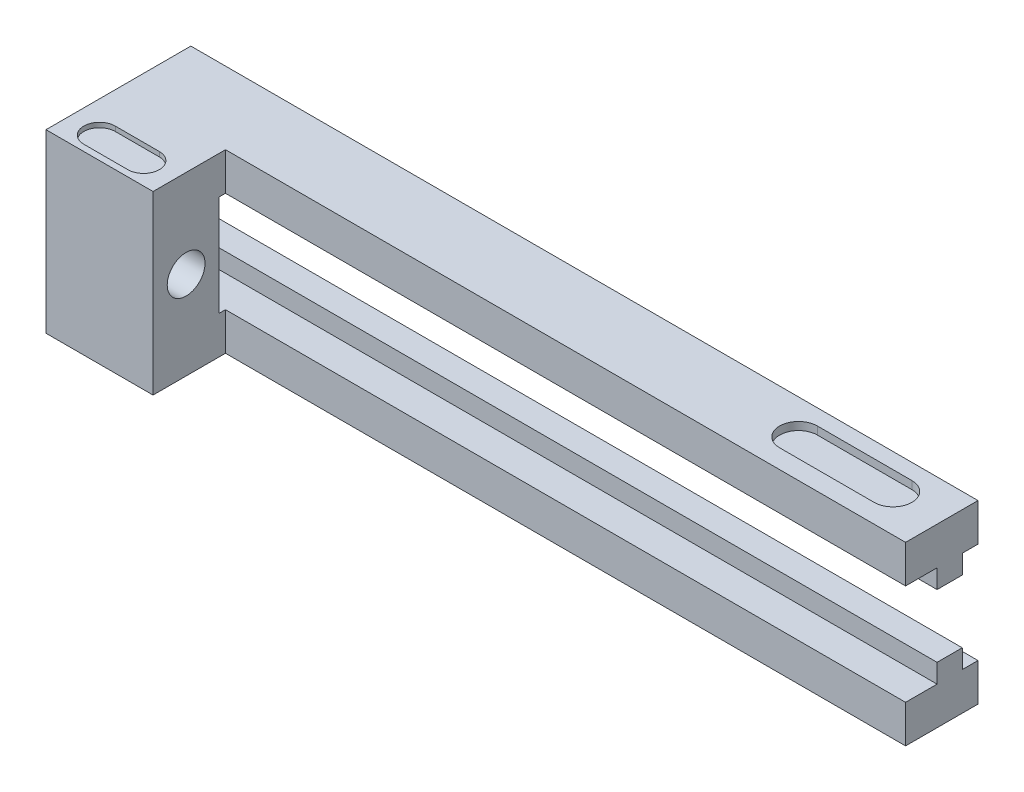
ISO-10303-21;
HEADER;
FILE_DESCRIPTION(('STEP AP214'),'2;1');
FILE_NAME('part.step','',(''),(''),'','','');
FILE_SCHEMA(('AUTOMOTIVE_DESIGN { 1 0 10303 214 1 1 1 1 }'));
ENDSEC;
DATA;
#1=APPLICATION_CONTEXT('core data for automotive mechanical design processes');
#2=APPLICATION_PROTOCOL_DEFINITION('international standard','automotive_design',2000,#1);
#3=PRODUCT_CONTEXT('',#1,'mechanical');
#4=PRODUCT('Part','Part','',(#3));
#5=PRODUCT_RELATED_PRODUCT_CATEGORY('part','',(#4));
#6=PRODUCT_DEFINITION_FORMATION('','',#4);
#7=PRODUCT_DEFINITION_CONTEXT('part definition',#1,'design');
#8=PRODUCT_DEFINITION('design','',#6,#7);
#9=PRODUCT_DEFINITION_SHAPE('','',#8);
#10=(LENGTH_UNIT() NAMED_UNIT(*) SI_UNIT(.MILLI.,.METRE.));
#11=(NAMED_UNIT(*) PLANE_ANGLE_UNIT() SI_UNIT($,.RADIAN.));
#12=(NAMED_UNIT(*) SI_UNIT($,.STERADIAN.) SOLID_ANGLE_UNIT());
#13=UNCERTAINTY_MEASURE_WITH_UNIT(LENGTH_MEASURE(1.E-05),#10,'distance_accuracy_value','');
#14=(GEOMETRIC_REPRESENTATION_CONTEXT(3) GLOBAL_UNCERTAINTY_ASSIGNED_CONTEXT((#13)) GLOBAL_UNIT_ASSIGNED_CONTEXT((#10,
#11,#12)) REPRESENTATION_CONTEXT('',''));
#15=CARTESIAN_POINT('',(0.,0.,0.));
#16=DIRECTION('',(0.,0.,1.));
#17=DIRECTION('',(1.,0.,0.));
#18=AXIS2_PLACEMENT_3D('',#15,#16,#17);
#19=CARTESIAN_POINT('',(17.,-26.5,34.));
#20=DIRECTION('',(0.,1.,0.));
#21=DIRECTION('',(0.,0.,-1.));
#22=AXIS2_PLACEMENT_3D('',#19,#20,#21);
#23=PLANE('',#22);
#24=DIRECTION('',(-1.,0.,0.));
#25=VECTOR('',#24,1.);
#26=CARTESIAN_POINT('',(24.,-26.5,39.));
#27=LINE('',#26,#25);
#28=CARTESIAN_POINT('',(10.,-26.5,39.));
#29=VERTEX_POINT('',#28);
#30=CARTESIAN_POINT('',(24.,-26.5,39.));
#31=VERTEX_POINT('',#30);
#32=EDGE_CURVE('E689',#29,#31,#27,.F.);
#33=ORIENTED_EDGE('',*,*,#32,.F.);
#34=CARTESIAN_POINT('',(10.,-26.5,34.));
#35=DIRECTION('',(0.,-1.,0.));
#36=DIRECTION('',(0.,0.,1.));
#37=AXIS2_PLACEMENT_3D('',#34,#35,#36);
#38=CIRCLE('',#37,5.);
#39=CARTESIAN_POINT('',(10.,-26.5,29.));
#40=VERTEX_POINT('',#39);
#41=EDGE_CURVE('E201',#29,#40,#38,.T.);
#42=ORIENTED_EDGE('',*,*,#41,.T.);
#43=DIRECTION('',(1.,0.,0.));
#44=VECTOR('',#43,1.);
#45=CARTESIAN_POINT('',(10.,-26.5,29.));
#46=LINE('',#45,#44);
#47=CARTESIAN_POINT('',(24.,-26.5,29.));
#48=VERTEX_POINT('',#47);
#49=EDGE_CURVE('E204',#48,#40,#46,.F.);
#50=ORIENTED_EDGE('',*,*,#49,.F.);
#51=CARTESIAN_POINT('',(24.,-26.5,34.));
#52=DIRECTION('',(0.,-1.,0.));
#53=DIRECTION('',(0.,0.,1.));
#54=AXIS2_PLACEMENT_3D('',#51,#52,#53);
#55=CIRCLE('',#54,5.);
#56=EDGE_CURVE('E197',#48,#31,#55,.T.);
#57=ORIENTED_EDGE('',*,*,#56,.T.);
#58=EDGE_LOOP('',(#33,#42,#50,#57));
#59=FACE_BOUND('',#58,.T.);
#60=ADVANCED_FACE('F14',(#59),#23,.F.);
#61=CARTESIAN_POINT('',(219.,-25.5,6.));
#62=DIRECTION('',(0.,-1.,0.));
#63=DIRECTION('',(1.,0.,0.));
#64=AXIS2_PLACEMENT_3D('',#61,#62,#63);
#65=PLANE('',#64);
#66=CARTESIAN_POINT('',(204.,-25.5,6.));
#67=DIRECTION('',(0.,1.,0.));
#68=DIRECTION('',(0.,0.,-1.));
#69=AXIS2_PLACEMENT_3D('',#66,#67,#68);
#70=CIRCLE('',#69,6.);
#71=CARTESIAN_POINT('',(204.,-25.5,12.));
#72=VERTEX_POINT('',#71);
#73=CARTESIAN_POINT('',(204.,-25.5,0.));
#74=VERTEX_POINT('',#73);
#75=EDGE_CURVE('E190',#72,#74,#70,.F.);
#76=ORIENTED_EDGE('',*,*,#75,.T.);
#77=DIRECTION('',(-1.,0.,0.));
#78=VECTOR('',#77,1.);
#79=CARTESIAN_POINT('',(234.,-25.5,0.));
#80=LINE('',#79,#78);
#81=CARTESIAN_POINT('',(234.,-25.5,0.));
#82=VERTEX_POINT('',#81);
#83=EDGE_CURVE('E685',#74,#82,#80,.F.);
#84=ORIENTED_EDGE('',*,*,#83,.T.);
#85=CARTESIAN_POINT('',(234.,-25.5,6.));
#86=DIRECTION('',(0.,1.,0.));
#87=DIRECTION('',(0.,0.,-1.));
#88=AXIS2_PLACEMENT_3D('',#85,#86,#87);
#89=CIRCLE('',#88,6.);
#90=CARTESIAN_POINT('',(234.,-25.5,12.));
#91=VERTEX_POINT('',#90);
#92=EDGE_CURVE('E193',#82,#91,#89,.F.);
#93=ORIENTED_EDGE('',*,*,#92,.T.);
#94=DIRECTION('',(1.,0.,0.));
#95=VECTOR('',#94,1.);
#96=CARTESIAN_POINT('',(204.,-25.5,12.));
#97=LINE('',#96,#95);
#98=EDGE_CURVE('E196',#91,#72,#97,.F.);
#99=ORIENTED_EDGE('',*,*,#98,.T.);
#100=EDGE_LOOP('',(#76,#84,#93,#99));
#101=FACE_BOUND('',#100,.T.);
#102=ADVANCED_FACE('F335',(#101),#65,.T.);
#103=CARTESIAN_POINT('',(17.,26.5,34.));
#104=DIRECTION('',(0.,1.,0.));
#105=DIRECTION('',(-1.,0.,0.));
#106=AXIS2_PLACEMENT_3D('',#103,#104,#105);
#107=PLANE('',#106);
#108=CARTESIAN_POINT('',(10.,26.5,34.));
#109=DIRECTION('',(0.,-1.,0.));
#110=DIRECTION('',(0.,0.,1.));
#111=AXIS2_PLACEMENT_3D('',#108,#109,#110);
#112=CIRCLE('',#111,5.);
#113=CARTESIAN_POINT('',(10.,26.5,29.));
#114=VERTEX_POINT('',#113);
#115=CARTESIAN_POINT('',(10.,26.5,39.));
#116=VERTEX_POINT('',#115);
#117=EDGE_CURVE('E18',#114,#116,#112,.F.);
#118=ORIENTED_EDGE('',*,*,#117,.T.);
#119=DIRECTION('',(1.,0.,0.));
#120=VECTOR('',#119,1.);
#121=CARTESIAN_POINT('',(24.,26.5,39.));
#122=LINE('',#121,#120);
#123=CARTESIAN_POINT('',(24.,26.5,39.));
#124=VERTEX_POINT('',#123);
#125=EDGE_CURVE('E167',#116,#124,#122,.T.);
#126=ORIENTED_EDGE('',*,*,#125,.T.);
#127=CARTESIAN_POINT('',(24.,26.5,34.));
#128=DIRECTION('',(0.,-1.,0.));
#129=DIRECTION('',(0.,0.,1.));
#130=AXIS2_PLACEMENT_3D('',#127,#128,#129);
#131=CIRCLE('',#130,5.);
#132=CARTESIAN_POINT('',(24.,26.5,29.));
#133=VERTEX_POINT('',#132);
#134=EDGE_CURVE('E138',#124,#133,#131,.F.);
#135=ORIENTED_EDGE('',*,*,#134,.T.);
#136=DIRECTION('',(-1.,0.,0.));
#137=VECTOR('',#136,1.);
#138=CARTESIAN_POINT('',(10.,26.5,29.));
#139=LINE('',#138,#137);
#140=EDGE_CURVE('E134',#133,#114,#139,.T.);
#141=ORIENTED_EDGE('',*,*,#140,.T.);
#142=EDGE_LOOP('',(#118,#126,#135,#141));
#143=FACE_BOUND('',#142,.T.);
#144=ADVANCED_FACE('F16',(#143),#107,.T.);
#145=CARTESIAN_POINT('',(219.,25.5,6.));
#146=DIRECTION('',(0.,-1.,0.));
#147=DIRECTION('',(1.,0.,0.));
#148=AXIS2_PLACEMENT_3D('',#145,#146,#147);
#149=PLANE('',#148);
#150=DIRECTION('',(1.,0.,0.));
#151=VECTOR('',#150,1.);
#152=CARTESIAN_POINT('',(234.,25.5,0.));
#153=LINE('',#152,#151);
#154=CARTESIAN_POINT('',(204.,25.5,0.));
#155=VERTEX_POINT('',#154);
#156=CARTESIAN_POINT('',(234.,25.5,0.));
#157=VERTEX_POINT('',#156);
#158=EDGE_CURVE('E159',#155,#157,#153,.T.);
#159=ORIENTED_EDGE('',*,*,#158,.F.);
#160=CARTESIAN_POINT('',(204.,25.5,6.));
#161=DIRECTION('',(0.,1.,0.));
#162=DIRECTION('',(0.,0.,-1.));
#163=AXIS2_PLACEMENT_3D('',#160,#161,#162);
#164=CIRCLE('',#163,6.);
#165=CARTESIAN_POINT('',(204.,25.5,12.));
#166=VERTEX_POINT('',#165);
#167=EDGE_CURVE('E217',#155,#166,#164,.T.);
#168=ORIENTED_EDGE('',*,*,#167,.T.);
#169=DIRECTION('',(-1.,0.,0.));
#170=VECTOR('',#169,1.);
#171=CARTESIAN_POINT('',(204.,25.5,12.));
#172=LINE('',#171,#170);
#173=CARTESIAN_POINT('',(234.,25.5,12.));
#174=VERTEX_POINT('',#173);
#175=EDGE_CURVE('E169',#174,#166,#172,.T.);
#176=ORIENTED_EDGE('',*,*,#175,.F.);
#177=CARTESIAN_POINT('',(234.,25.5,6.));
#178=DIRECTION('',(0.,1.,0.));
#179=DIRECTION('',(0.,0.,-1.));
#180=AXIS2_PLACEMENT_3D('',#177,#178,#179);
#181=CIRCLE('',#180,6.);
#182=EDGE_CURVE('E157',#174,#157,#181,.T.);
#183=ORIENTED_EDGE('',*,*,#182,.T.);
#184=EDGE_LOOP('',(#159,#168,#176,#183));
#185=FACE_BOUND('',#184,.T.);
#186=ADVANCED_FACE('F322',(#185),#149,.F.);
#187=CARTESIAN_POINT('',(0.,-16.,0.));
#188=DIRECTION('',(0.,0.,-1.));
#189=DIRECTION('',(0.,-1.,0.));
#190=AXIS2_PLACEMENT_3D('',#187,#188,#189);
#191=PLANE('',#190);
#192=DIRECTION('',(0.,1.,0.));
#193=VECTOR('',#192,1.);
#194=CARTESIAN_POINT('',(250.,-20.0975609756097,0.));
#195=LINE('',#194,#193);
#196=CARTESIAN_POINT('',(250.,-16.,0.));
#197=VERTEX_POINT('',#196);
#198=CARTESIAN_POINT('',(250.,-10.,0.));
#199=VERTEX_POINT('',#198);
#200=EDGE_CURVE('E744',#197,#199,#195,.T.);
#201=ORIENTED_EDGE('',*,*,#200,.F.);
#202=DIRECTION('',(-1.,0.,0.));
#203=VECTOR('',#202,1.);
#204=CARTESIAN_POINT('',(0.,-16.,0.));
#205=LINE('',#204,#203);
#206=CARTESIAN_POINT('',(0.,-16.,0.));
#207=VERTEX_POINT('',#206);
#208=EDGE_CURVE('E267',#197,#207,#205,.T.);
#209=ORIENTED_EDGE('',*,*,#208,.T.);
#210=DIRECTION('',(0.,1.,0.));
#211=VECTOR('',#210,1.);
#212=CARTESIAN_POINT('',(0.,20.0975609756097,0.));
#213=LINE('',#212,#211);
#214=CARTESIAN_POINT('',(0.,-10.,0.));
#215=VERTEX_POINT('',#214);
#216=EDGE_CURVE('E641',#207,#215,#213,.T.);
#217=ORIENTED_EDGE('',*,*,#216,.T.);
#218=DIRECTION('',(-1.,0.,0.));
#219=VECTOR('',#218,1.);
#220=CARTESIAN_POINT('',(0.,-10.,0.));
#221=LINE('',#220,#219);
#222=EDGE_CURVE('E264',#199,#215,#221,.T.);
#223=ORIENTED_EDGE('',*,*,#222,.F.);
#224=EDGE_LOOP('',(#201,#209,#217,#223));
#225=FACE_BOUND('',#224,.T.);
#226=ADVANCED_FACE('F378',(#225),#191,.T.);
#227=CARTESIAN_POINT('',(0.,10.,0.));
#228=DIRECTION('',(0.,1.,0.));
#229=DIRECTION('',(0.,0.,-1.));
#230=AXIS2_PLACEMENT_3D('',#227,#228,#229);
#231=PLANE('',#230);
#232=DIRECTION('',(-1.,0.,0.));
#233=VECTOR('',#232,1.);
#234=CARTESIAN_POINT('',(0.,10.,0.));
#235=LINE('',#234,#233);
#236=CARTESIAN_POINT('',(0.,10.,0.));
#237=VERTEX_POINT('',#236);
#238=CARTESIAN_POINT('',(250.,10.,0.));
#239=VERTEX_POINT('',#238);
#240=EDGE_CURVE('E285',#237,#239,#235,.F.);
#241=ORIENTED_EDGE('',*,*,#240,.T.);
#242=DIRECTION('',(0.,0.,-1.));
#243=VECTOR('',#242,1.);
#244=CARTESIAN_POINT('',(250.,10.,0.));
#245=LINE('',#244,#243);
#246=CARTESIAN_POINT('',(250.,10.,8.));
#247=VERTEX_POINT('',#246);
#248=EDGE_CURVE('E288',#247,#239,#245,.T.);
#249=ORIENTED_EDGE('',*,*,#248,.F.);
#250=DIRECTION('',(-1.,0.,0.));
#251=VECTOR('',#250,1.);
#252=CARTESIAN_POINT('',(0.,10.,8.));
#253=LINE('',#252,#251);
#254=CARTESIAN_POINT('',(0.,10.,8.));
#255=VERTEX_POINT('',#254);
#256=EDGE_CURVE('E291',#255,#247,#253,.F.);
#257=ORIENTED_EDGE('',*,*,#256,.F.);
#258=DIRECTION('',(0.,0.,-1.));
#259=VECTOR('',#258,1.);
#260=CARTESIAN_POINT('',(0.,10.,6.1341463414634));
#261=LINE('',#260,#259);
#262=EDGE_CURVE('E663',#255,#237,#261,.T.);
#263=ORIENTED_EDGE('',*,*,#262,.T.);
#264=EDGE_LOOP('',(#241,#249,#257,#263));
#265=FACE_BOUND('',#264,.T.);
#266=ADVANCED_FACE('F381',(#265),#231,.F.);
#267=CARTESIAN_POINT('',(0.,16.,0.));
#268=DIRECTION('',(0.,0.,1.));
#269=DIRECTION('',(0.,1.,0.));
#270=AXIS2_PLACEMENT_3D('',#267,#268,#269);
#271=PLANE('',#270);
#272=DIRECTION('',(-1.,0.,0.));
#273=VECTOR('',#272,1.);
#274=CARTESIAN_POINT('',(0.,16.,0.));
#275=LINE('',#274,#273);
#276=CARTESIAN_POINT('',(0.,16.,0.));
#277=VERTEX_POINT('',#276);
#278=CARTESIAN_POINT('',(250.,16.,0.));
#279=VERTEX_POINT('',#278);
#280=EDGE_CURVE('E279',#277,#279,#275,.F.);
#281=ORIENTED_EDGE('',*,*,#280,.T.);
#282=DIRECTION('',(0.,1.,0.));
#283=VECTOR('',#282,1.);
#284=CARTESIAN_POINT('',(250.,16.,0.));
#285=LINE('',#284,#283);
#286=EDGE_CURVE('E282',#239,#279,#285,.T.);
#287=ORIENTED_EDGE('',*,*,#286,.F.);
#288=ORIENTED_EDGE('',*,*,#240,.F.);
#289=DIRECTION('',(0.,1.,0.));
#290=VECTOR('',#289,1.);
#291=CARTESIAN_POINT('',(0.,20.0975609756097,0.));
#292=LINE('',#291,#290);
#293=EDGE_CURVE('E660',#237,#277,#292,.T.);
#294=ORIENTED_EDGE('',*,*,#293,.T.);
#295=EDGE_LOOP('',(#281,#287,#288,#294));
#296=FACE_BOUND('',#295,.T.);
#297=ADVANCED_FACE('F394',(#296),#271,.F.);
#298=CARTESIAN_POINT('',(0.,16.,-5.));
#299=DIRECTION('',(0.,1.,0.));
#300=DIRECTION('',(0.,0.,-1.));
#301=AXIS2_PLACEMENT_3D('',#298,#299,#300);
#302=PLANE('',#301);
#303=DIRECTION('',(0.,0.,-1.));
#304=VECTOR('',#303,1.);
#305=CARTESIAN_POINT('',(250.,16.,-5.));
#306=LINE('',#305,#304);
#307=CARTESIAN_POINT('',(250.,16.,-5.));
#308=VERTEX_POINT('',#307);
#309=EDGE_CURVE('E276',#279,#308,#306,.T.);
#310=ORIENTED_EDGE('',*,*,#309,.F.);
#311=ORIENTED_EDGE('',*,*,#280,.F.);
#312=DIRECTION('',(0.,0.,-1.));
#313=VECTOR('',#312,1.);
#314=CARTESIAN_POINT('',(0.,16.,6.1341463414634));
#315=LINE('',#314,#313);
#316=CARTESIAN_POINT('',(0.,16.,-5.));
#317=VERTEX_POINT('',#316);
#318=EDGE_CURVE('E657',#277,#317,#315,.T.);
#319=ORIENTED_EDGE('',*,*,#318,.T.);
#320=DIRECTION('',(-1.,0.,0.));
#321=VECTOR('',#320,1.);
#322=CARTESIAN_POINT('',(0.,16.,-5.));
#323=LINE('',#322,#321);
#324=EDGE_CURVE('E273',#317,#308,#323,.F.);
#325=ORIENTED_EDGE('',*,*,#324,.T.);
#326=EDGE_LOOP('',(#310,#311,#319,#325));
#327=FACE_BOUND('',#326,.T.);
#328=ADVANCED_FACE('F385',(#327),#302,.F.);
#329=CARTESIAN_POINT('',(0.,-16.,-5.));
#330=DIRECTION('',(0.,1.,0.));
#331=DIRECTION('',(0.,0.,-1.));
#332=AXIS2_PLACEMENT_3D('',#329,#330,#331);
#333=PLANE('',#332);
#334=DIRECTION('',(0.,0.,1.));
#335=VECTOR('',#334,1.);
#336=CARTESIAN_POINT('',(250.,-16.,6.1341463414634));
#337=LINE('',#336,#335);
#338=CARTESIAN_POINT('',(250.,-16.,-5.));
#339=VERTEX_POINT('',#338);
#340=EDGE_CURVE('E645',#339,#197,#337,.T.);
#341=ORIENTED_EDGE('',*,*,#340,.F.);
#342=DIRECTION('',(-1.,0.,0.));
#343=VECTOR('',#342,1.);
#344=CARTESIAN_POINT('',(0.,-16.,-5.));
#345=LINE('',#344,#343);
#346=CARTESIAN_POINT('',(0.,-16.,-5.));
#347=VERTEX_POINT('',#346);
#348=EDGE_CURVE('E625',#347,#339,#345,.F.);
#349=ORIENTED_EDGE('',*,*,#348,.F.);
#350=DIRECTION('',(0.,0.,-1.));
#351=VECTOR('',#350,1.);
#352=CARTESIAN_POINT('',(0.,-16.,6.1341463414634));
#353=LINE('',#352,#351);
#354=EDGE_CURVE('E638',#347,#207,#353,.F.);
#355=ORIENTED_EDGE('',*,*,#354,.T.);
#356=ORIENTED_EDGE('',*,*,#208,.F.);
#357=EDGE_LOOP('',(#341,#349,#355,#356));
#358=FACE_BOUND('',#357,.T.);
#359=ADVANCED_FACE('F376',(#358),#333,.T.);
#360=CARTESIAN_POINT('',(0.,-10.,0.));
#361=DIRECTION('',(0.,1.,0.));
#362=DIRECTION('',(0.,0.,-1.));
#363=AXIS2_PLACEMENT_3D('',#360,#361,#362);
#364=PLANE('',#363);
#365=DIRECTION('',(0.,0.,1.));
#366=VECTOR('',#365,1.);
#367=CARTESIAN_POINT('',(250.,-10.,6.1341463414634));
#368=LINE('',#367,#366);
#369=CARTESIAN_POINT('',(250.,-10.,8.));
#370=VERTEX_POINT('',#369);
#371=EDGE_CURVE('E741',#199,#370,#368,.T.);
#372=ORIENTED_EDGE('',*,*,#371,.F.);
#373=ORIENTED_EDGE('',*,*,#222,.T.);
#374=DIRECTION('',(0.,0.,-1.));
#375=VECTOR('',#374,1.);
#376=CARTESIAN_POINT('',(0.,-10.,6.1341463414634));
#377=LINE('',#376,#375);
#378=CARTESIAN_POINT('',(0.,-10.,8.));
#379=VERTEX_POINT('',#378);
#380=EDGE_CURVE('E681',#215,#379,#377,.F.);
#381=ORIENTED_EDGE('',*,*,#380,.T.);
#382=DIRECTION('',(-1.,0.,0.));
#383=VECTOR('',#382,1.);
#384=CARTESIAN_POINT('',(0.,-10.,8.));
#385=LINE('',#384,#383);
#386=EDGE_CURVE('E261',#370,#379,#385,.T.);
#387=ORIENTED_EDGE('',*,*,#386,.F.);
#388=EDGE_LOOP('',(#372,#373,#381,#387));
#389=FACE_BOUND('',#388,.T.);
#390=ADVANCED_FACE('F372',(#389),#364,.T.);
#391=CARTESIAN_POINT('',(10.,-28.,34.));
#392=DIRECTION('',(0.,-1.,0.));
#393=DIRECTION('',(0.,0.,1.));
#394=AXIS2_PLACEMENT_3D('',#391,#392,#393);
#395=CYLINDRICAL_SURFACE('',#394,5.);
#396=DIRECTION('',(0.,-1.,0.));
#397=VECTOR('',#396,1.);
#398=CARTESIAN_POINT('',(10.,-28.,29.));
#399=LINE('',#398,#397);
#400=CARTESIAN_POINT('',(10.,-28.,29.));
#401=VERTEX_POINT('',#400);
#402=EDGE_CURVE('E203',#40,#401,#399,.T.);
#403=ORIENTED_EDGE('',*,*,#402,.F.);
#404=ORIENTED_EDGE('',*,*,#41,.F.);
#405=DIRECTION('',(0.,1.,0.));
#406=VECTOR('',#405,1.);
#407=CARTESIAN_POINT('',(10.,-28.,39.));
#408=LINE('',#407,#406);
#409=CARTESIAN_POINT('',(10.,-28.,39.));
#410=VERTEX_POINT('',#409);
#411=EDGE_CURVE('E692',#410,#29,#408,.T.);
#412=ORIENTED_EDGE('',*,*,#411,.F.);
#413=CARTESIAN_POINT('',(10.,-28.,34.));
#414=DIRECTION('',(0.,-1.,0.));
#415=DIRECTION('',(0.,0.,1.));
#416=AXIS2_PLACEMENT_3D('',#413,#414,#415);
#417=CIRCLE('',#416,5.);
#418=EDGE_CURVE('E186',#401,#410,#417,.F.);
#419=ORIENTED_EDGE('',*,*,#418,.F.);
#420=EDGE_LOOP('',(#403,#404,#412,#419));
#421=FACE_BOUND('',#420,.T.);
#422=ADVANCED_FACE('F375',(#421),#395,.F.);
#423=CARTESIAN_POINT('',(10.,-28.,29.));
#424=DIRECTION('',(0.,0.,1.));
#425=DIRECTION('',(1.,0.,0.));
#426=AXIS2_PLACEMENT_3D('',#423,#424,#425);
#427=PLANE('',#426);
#428=ORIENTED_EDGE('',*,*,#49,.T.);
#429=ORIENTED_EDGE('',*,*,#402,.T.);
#430=DIRECTION('',(1.,0.,0.));
#431=VECTOR('',#430,1.);
#432=CARTESIAN_POINT('',(0.,-28.,29.));
#433=LINE('',#432,#431);
#434=CARTESIAN_POINT('',(24.,-28.,29.));
#435=VERTEX_POINT('',#434);
#436=EDGE_CURVE('E189',#435,#401,#433,.F.);
#437=ORIENTED_EDGE('',*,*,#436,.F.);
#438=DIRECTION('',(0.,-1.,0.));
#439=VECTOR('',#438,1.);
#440=CARTESIAN_POINT('',(24.,-28.,29.));
#441=LINE('',#440,#439);
#442=EDGE_CURVE('E200',#435,#48,#441,.F.);
#443=ORIENTED_EDGE('',*,*,#442,.T.);
#444=EDGE_LOOP('',(#428,#429,#437,#443));
#445=FACE_BOUND('',#444,.T.);
#446=ADVANCED_FACE('F600',(#445),#427,.T.);
#447=CARTESIAN_POINT('',(24.,-28.,34.));
#448=DIRECTION('',(0.,-1.,0.));
#449=DIRECTION('',(0.,0.,1.));
#450=AXIS2_PLACEMENT_3D('',#447,#448,#449);
#451=CYLINDRICAL_SURFACE('',#450,5.);
#452=DIRECTION('',(0.,-1.,0.));
#453=VECTOR('',#452,1.);
#454=CARTESIAN_POINT('',(24.,-28.,39.));
#455=LINE('',#454,#453);
#456=CARTESIAN_POINT('',(24.,-28.,39.));
#457=VERTEX_POINT('',#456);
#458=EDGE_CURVE('E199',#31,#457,#455,.T.);
#459=ORIENTED_EDGE('',*,*,#458,.F.);
#460=ORIENTED_EDGE('',*,*,#56,.F.);
#461=ORIENTED_EDGE('',*,*,#442,.F.);
#462=CARTESIAN_POINT('',(24.,-28.,34.));
#463=DIRECTION('',(0.,-1.,0.));
#464=DIRECTION('',(0.,0.,1.));
#465=AXIS2_PLACEMENT_3D('',#462,#463,#464);
#466=CIRCLE('',#465,5.);
#467=EDGE_CURVE('E182',#457,#435,#466,.F.);
#468=ORIENTED_EDGE('',*,*,#467,.F.);
#469=EDGE_LOOP('',(#459,#460,#461,#468));
#470=FACE_BOUND('',#469,.T.);
#471=ADVANCED_FACE('F597',(#470),#451,.F.);
#472=CARTESIAN_POINT('',(24.,-28.,39.));
#473=DIRECTION('',(0.,0.,-1.));
#474=DIRECTION('',(-1.,0.,0.));
#475=AXIS2_PLACEMENT_3D('',#472,#473,#474);
#476=PLANE('',#475);
#477=ORIENTED_EDGE('',*,*,#32,.T.);
#478=ORIENTED_EDGE('',*,*,#458,.T.);
#479=DIRECTION('',(1.,0.,0.));
#480=VECTOR('',#479,1.);
#481=CARTESIAN_POINT('',(0.,-28.,39.));
#482=LINE('',#481,#480);
#483=EDGE_CURVE('E185',#410,#457,#482,.T.);
#484=ORIENTED_EDGE('',*,*,#483,.F.);
#485=ORIENTED_EDGE('',*,*,#411,.T.);
#486=EDGE_LOOP('',(#477,#478,#484,#485));
#487=FACE_BOUND('',#486,.T.);
#488=ADVANCED_FACE('F592',(#487),#476,.T.);
#489=CARTESIAN_POINT('',(234.,-28.,6.));
#490=DIRECTION('',(0.,1.,0.));
#491=DIRECTION('',(0.,0.,-1.));
#492=AXIS2_PLACEMENT_3D('',#489,#490,#491);
#493=CYLINDRICAL_SURFACE('',#492,6.);
#494=DIRECTION('',(0.,1.,0.));
#495=VECTOR('',#494,1.);
#496=CARTESIAN_POINT('',(234.,-28.,12.));
#497=LINE('',#496,#495);
#498=CARTESIAN_POINT('',(234.,-28.,12.));
#499=VERTEX_POINT('',#498);
#500=EDGE_CURVE('E195',#91,#499,#497,.F.);
#501=ORIENTED_EDGE('',*,*,#500,.F.);
#502=ORIENTED_EDGE('',*,*,#92,.F.);
#503=DIRECTION('',(0.,1.,0.));
#504=VECTOR('',#503,1.);
#505=CARTESIAN_POINT('',(234.,-28.,0.));
#506=LINE('',#505,#504);
#507=CARTESIAN_POINT('',(234.,-28.,0.));
#508=VERTEX_POINT('',#507);
#509=EDGE_CURVE('E687',#82,#508,#506,.F.);
#510=ORIENTED_EDGE('',*,*,#509,.T.);
#511=CARTESIAN_POINT('',(234.,-28.,6.));
#512=DIRECTION('',(0.,1.,0.));
#513=DIRECTION('',(0.,0.,-1.));
#514=AXIS2_PLACEMENT_3D('',#511,#512,#513);
#515=CIRCLE('',#514,6.);
#516=EDGE_CURVE('E178',#499,#508,#515,.T.);
#517=ORIENTED_EDGE('',*,*,#516,.F.);
#518=EDGE_LOOP('',(#501,#502,#510,#517));
#519=FACE_BOUND('',#518,.T.);
#520=ADVANCED_FACE('F589',(#519),#493,.F.);
#521=CARTESIAN_POINT('',(204.,-28.,12.));
#522=DIRECTION('',(0.,0.,1.));
#523=DIRECTION('',(1.,0.,0.));
#524=AXIS2_PLACEMENT_3D('',#521,#522,#523);
#525=PLANE('',#524);
#526=DIRECTION('',(0.,1.,0.));
#527=VECTOR('',#526,1.);
#528=CARTESIAN_POINT('',(204.,-28.,12.));
#529=LINE('',#528,#527);
#530=CARTESIAN_POINT('',(204.,-28.,12.));
#531=VERTEX_POINT('',#530);
#532=EDGE_CURVE('E192',#531,#72,#529,.T.);
#533=ORIENTED_EDGE('',*,*,#532,.T.);
#534=ORIENTED_EDGE('',*,*,#98,.F.);
#535=ORIENTED_EDGE('',*,*,#500,.T.);
#536=DIRECTION('',(1.,0.,0.));
#537=VECTOR('',#536,1.);
#538=CARTESIAN_POINT('',(0.,-28.,12.));
#539=LINE('',#538,#537);
#540=EDGE_CURVE('E181',#531,#499,#539,.T.);
#541=ORIENTED_EDGE('',*,*,#540,.F.);
#542=EDGE_LOOP('',(#533,#534,#535,#541));
#543=FACE_BOUND('',#542,.T.);
#544=ADVANCED_FACE('F585',(#543),#525,.F.);
#545=CARTESIAN_POINT('',(204.,-28.,6.));
#546=DIRECTION('',(0.,1.,0.));
#547=DIRECTION('',(0.,0.,-1.));
#548=AXIS2_PLACEMENT_3D('',#545,#546,#547);
#549=CYLINDRICAL_SURFACE('',#548,6.);
#550=DIRECTION('',(0.,1.,0.));
#551=VECTOR('',#550,1.);
#552=CARTESIAN_POINT('',(204.,-28.,0.));
#553=LINE('',#552,#551);
#554=CARTESIAN_POINT('',(204.,-28.,0.));
#555=VERTEX_POINT('',#554);
#556=EDGE_CURVE('E33',#74,#555,#553,.F.);
#557=ORIENTED_EDGE('',*,*,#556,.F.);
#558=ORIENTED_EDGE('',*,*,#75,.F.);
#559=ORIENTED_EDGE('',*,*,#532,.F.);
#560=CARTESIAN_POINT('',(204.,-28.,6.));
#561=DIRECTION('',(0.,1.,0.));
#562=DIRECTION('',(0.,0.,-1.));
#563=AXIS2_PLACEMENT_3D('',#560,#561,#562);
#564=CIRCLE('',#563,6.);
#565=EDGE_CURVE('E9',#555,#531,#564,.T.);
#566=ORIENTED_EDGE('',*,*,#565,.F.);
#567=EDGE_LOOP('',(#557,#558,#559,#566));
#568=FACE_BOUND('',#567,.T.);
#569=ADVANCED_FACE('F581',(#568),#549,.F.);
#570=CARTESIAN_POINT('',(234.,-28.,0.));
#571=DIRECTION('',(0.,0.,-1.));
#572=DIRECTION('',(-1.,0.,0.));
#573=AXIS2_PLACEMENT_3D('',#570,#571,#572);
#574=PLANE('',#573);
#575=ORIENTED_EDGE('',*,*,#509,.F.);
#576=ORIENTED_EDGE('',*,*,#83,.F.);
#577=ORIENTED_EDGE('',*,*,#556,.T.);
#578=DIRECTION('',(1.,0.,0.));
#579=VECTOR('',#578,1.);
#580=CARTESIAN_POINT('',(0.,-28.,0.));
#581=LINE('',#580,#579);
#582=EDGE_CURVE('E24',#508,#555,#581,.F.);
#583=ORIENTED_EDGE('',*,*,#582,.F.);
#584=EDGE_LOOP('',(#575,#576,#577,#583));
#585=FACE_BOUND('',#584,.T.);
#586=ADVANCED_FACE('F584',(#585),#574,.F.);
#587=CARTESIAN_POINT('',(0.,-28.,-5.));
#588=DIRECTION('',(0.,0.,-1.));
#589=DIRECTION('',(-1.,0.,0.));
#590=AXIS2_PLACEMENT_3D('',#587,#588,#589);
#591=PLANE('',#590);
#592=DIRECTION('',(0.,1.,0.));
#593=VECTOR('',#592,1.);
#594=CARTESIAN_POINT('',(0.,-28.,-5.));
#595=LINE('',#594,#593);
#596=CARTESIAN_POINT('',(0.,-28.,-5.));
#597=VERTEX_POINT('',#596);
#598=EDGE_CURVE('E620',#597,#347,#595,.T.);
#599=ORIENTED_EDGE('',*,*,#598,.T.);
#600=ORIENTED_EDGE('',*,*,#348,.T.);
#601=DIRECTION('',(0.,1.,0.));
#602=VECTOR('',#601,1.);
#603=CARTESIAN_POINT('',(250.,-20.0975609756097,-5.));
#604=LINE('',#603,#602);
#605=CARTESIAN_POINT('',(250.,-28.,-5.));
#606=VERTEX_POINT('',#605);
#607=EDGE_CURVE('E647',#606,#339,#604,.T.);
#608=ORIENTED_EDGE('',*,*,#607,.F.);
#609=DIRECTION('',(1.,0.,0.));
#610=VECTOR('',#609,1.);
#611=CARTESIAN_POINT('',(0.,-28.,-5.));
#612=LINE('',#611,#610);
#613=EDGE_CURVE('E629',#597,#606,#612,.T.);
#614=ORIENTED_EDGE('',*,*,#613,.F.);
#615=EDGE_LOOP('',(#599,#600,#608,#614));
#616=FACE_BOUND('',#615,.T.);
#617=ADVANCED_FACE('F390',(#616),#591,.T.);
#618=CARTESIAN_POINT('',(0.,28.,-5.));
#619=DIRECTION('',(0.,0.,1.));
#620=DIRECTION('',(0.,1.,0.));
#621=AXIS2_PLACEMENT_3D('',#618,#619,#620);
#622=PLANE('',#621);
#623=DIRECTION('',(0.,1.,0.));
#624=VECTOR('',#623,1.);
#625=CARTESIAN_POINT('',(250.,28.,-5.));
#626=LINE('',#625,#624);
#627=CARTESIAN_POINT('',(250.,28.,-5.));
#628=VERTEX_POINT('',#627);
#629=EDGE_CURVE('E270',#308,#628,#626,.T.);
#630=ORIENTED_EDGE('',*,*,#629,.F.);
#631=ORIENTED_EDGE('',*,*,#324,.F.);
#632=DIRECTION('',(0.,1.,0.));
#633=VECTOR('',#632,1.);
#634=CARTESIAN_POINT('',(0.,20.0975609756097,-5.));
#635=LINE('',#634,#633);
#636=CARTESIAN_POINT('',(0.,28.,-5.));
#637=VERTEX_POINT('',#636);
#638=EDGE_CURVE('E654',#317,#637,#635,.T.);
#639=ORIENTED_EDGE('',*,*,#638,.T.);
#640=DIRECTION('',(-1.,0.,0.));
#641=VECTOR('',#640,1.);
#642=CARTESIAN_POINT('',(0.,28.,-5.));
#643=LINE('',#642,#641);
#644=EDGE_CURVE('E237',#637,#628,#643,.F.);
#645=ORIENTED_EDGE('',*,*,#644,.T.);
#646=EDGE_LOOP('',(#630,#631,#639,#645));
#647=FACE_BOUND('',#646,.T.);
#648=ADVANCED_FACE('F387',(#647),#622,.F.);
#649=CARTESIAN_POINT('',(10.,28.,29.));
#650=DIRECTION('',(0.,0.,-1.));
#651=DIRECTION('',(-1.,0.,0.));
#652=AXIS2_PLACEMENT_3D('',#649,#650,#651);
#653=PLANE('',#652);
#654=DIRECTION('',(0.,1.,0.));
#655=VECTOR('',#654,1.);
#656=CARTESIAN_POINT('',(10.,28.,29.));
#657=LINE('',#656,#655);
#658=CARTESIAN_POINT('',(10.,28.,29.));
#659=VERTEX_POINT('',#658);
#660=EDGE_CURVE('E143',#114,#659,#657,.T.);
#661=ORIENTED_EDGE('',*,*,#660,.F.);
#662=ORIENTED_EDGE('',*,*,#140,.F.);
#663=DIRECTION('',(0.,1.,0.));
#664=VECTOR('',#663,1.);
#665=CARTESIAN_POINT('',(24.,28.,29.));
#666=LINE('',#665,#664);
#667=CARTESIAN_POINT('',(24.,28.,29.));
#668=VERTEX_POINT('',#667);
#669=EDGE_CURVE('E144',#668,#133,#666,.F.);
#670=ORIENTED_EDGE('',*,*,#669,.F.);
#671=DIRECTION('',(-1.,0.,0.));
#672=VECTOR('',#671,1.);
#673=CARTESIAN_POINT('',(0.,28.,29.));
#674=LINE('',#673,#672);
#675=EDGE_CURVE('E155',#668,#659,#674,.T.);
#676=ORIENTED_EDGE('',*,*,#675,.T.);
#677=EDGE_LOOP('',(#661,#662,#670,#676));
#678=FACE_BOUND('',#677,.T.);
#679=ADVANCED_FACE('F153',(#678),#653,.F.);
#680=CARTESIAN_POINT('',(10.,28.,34.));
#681=DIRECTION('',(0.,-1.,0.));
#682=DIRECTION('',(0.,0.,1.));
#683=AXIS2_PLACEMENT_3D('',#680,#681,#682);
#684=CYLINDRICAL_SURFACE('',#683,5.);
#685=DIRECTION('',(0.,1.,0.));
#686=VECTOR('',#685,1.);
#687=CARTESIAN_POINT('',(10.,28.,39.));
#688=LINE('',#687,#686);
#689=CARTESIAN_POINT('',(10.,28.,39.));
#690=VERTEX_POINT('',#689);
#691=EDGE_CURVE('E150',#690,#116,#688,.F.);
#692=ORIENTED_EDGE('',*,*,#691,.T.);
#693=ORIENTED_EDGE('',*,*,#117,.F.);
#694=ORIENTED_EDGE('',*,*,#660,.T.);
#695=CARTESIAN_POINT('',(10.,28.,34.));
#696=DIRECTION('',(0.,-1.,0.));
#697=DIRECTION('',(0.,0.,1.));
#698=AXIS2_PLACEMENT_3D('',#695,#696,#697);
#699=CIRCLE('',#698,5.);
#700=EDGE_CURVE('E214',#659,#690,#699,.F.);
#701=ORIENTED_EDGE('',*,*,#700,.T.);
#702=EDGE_LOOP('',(#692,#693,#694,#701));
#703=FACE_BOUND('',#702,.T.);
#704=ADVANCED_FACE('F147',(#703),#684,.F.);
#705=CARTESIAN_POINT('',(24.,28.,39.));
#706=DIRECTION('',(0.,0.,1.));
#707=DIRECTION('',(1.,0.,0.));
#708=AXIS2_PLACEMENT_3D('',#705,#706,#707);
#709=PLANE('',#708);
#710=DIRECTION('',(0.,-1.,0.));
#711=VECTOR('',#710,1.);
#712=CARTESIAN_POINT('',(24.,28.,39.));
#713=LINE('',#712,#711);
#714=CARTESIAN_POINT('',(24.,28.,39.));
#715=VERTEX_POINT('',#714);
#716=EDGE_CURVE('E164',#715,#124,#713,.T.);
#717=ORIENTED_EDGE('',*,*,#716,.T.);
#718=ORIENTED_EDGE('',*,*,#125,.F.);
#719=ORIENTED_EDGE('',*,*,#691,.F.);
#720=DIRECTION('',(-1.,0.,0.));
#721=VECTOR('',#720,1.);
#722=CARTESIAN_POINT('',(0.,28.,39.));
#723=LINE('',#722,#721);
#724=EDGE_CURVE('E213',#690,#715,#723,.F.);
#725=ORIENTED_EDGE('',*,*,#724,.T.);
#726=EDGE_LOOP('',(#717,#718,#719,#725));
#727=FACE_BOUND('',#726,.T.);
#728=ADVANCED_FACE('F934',(#727),#709,.F.);
#729=CARTESIAN_POINT('',(24.,28.,34.));
#730=DIRECTION('',(0.,-1.,0.));
#731=DIRECTION('',(0.,0.,1.));
#732=AXIS2_PLACEMENT_3D('',#729,#730,#731);
#733=CYLINDRICAL_SURFACE('',#732,5.);
#734=ORIENTED_EDGE('',*,*,#669,.T.);
#735=ORIENTED_EDGE('',*,*,#134,.F.);
#736=ORIENTED_EDGE('',*,*,#716,.F.);
#737=CARTESIAN_POINT('',(24.,28.,34.));
#738=DIRECTION('',(0.,-1.,0.));
#739=DIRECTION('',(0.,0.,1.));
#740=AXIS2_PLACEMENT_3D('',#737,#738,#739);
#741=CIRCLE('',#740,5.);
#742=EDGE_CURVE('E211',#715,#668,#741,.F.);
#743=ORIENTED_EDGE('',*,*,#742,.T.);
#744=EDGE_LOOP('',(#734,#735,#736,#743));
#745=FACE_BOUND('',#744,.T.);
#746=ADVANCED_FACE('F220',(#745),#733,.F.);
#747=CARTESIAN_POINT('',(204.,28.,12.));
#748=DIRECTION('',(0.,0.,-1.));
#749=DIRECTION('',(-1.,0.,0.));
#750=AXIS2_PLACEMENT_3D('',#747,#748,#749);
#751=PLANE('',#750);
#752=ORIENTED_EDGE('',*,*,#175,.T.);
#753=DIRECTION('',(0.,1.,0.));
#754=VECTOR('',#753,1.);
#755=CARTESIAN_POINT('',(204.,28.,12.));
#756=LINE('',#755,#754);
#757=CARTESIAN_POINT('',(204.,28.,12.));
#758=VERTEX_POINT('',#757);
#759=EDGE_CURVE('E172',#166,#758,#756,.T.);
#760=ORIENTED_EDGE('',*,*,#759,.T.);
#761=DIRECTION('',(-1.,0.,0.));
#762=VECTOR('',#761,1.);
#763=CARTESIAN_POINT('',(0.,28.,12.));
#764=LINE('',#763,#762);
#765=CARTESIAN_POINT('',(234.,28.,12.));
#766=VERTEX_POINT('',#765);
#767=EDGE_CURVE('E207',#758,#766,#764,.F.);
#768=ORIENTED_EDGE('',*,*,#767,.T.);
#769=DIRECTION('',(0.,1.,0.));
#770=VECTOR('',#769,1.);
#771=CARTESIAN_POINT('',(234.,28.,12.));
#772=LINE('',#771,#770);
#773=EDGE_CURVE('E173',#766,#174,#772,.F.);
#774=ORIENTED_EDGE('',*,*,#773,.T.);
#775=EDGE_LOOP('',(#752,#760,#768,#774));
#776=FACE_BOUND('',#775,.T.);
#777=ADVANCED_FACE('F319',(#776),#751,.T.);
#778=CARTESIAN_POINT('',(234.,28.,6.));
#779=DIRECTION('',(0.,1.,0.));
#780=DIRECTION('',(0.,0.,-1.));
#781=AXIS2_PLACEMENT_3D('',#778,#779,#780);
#782=CYLINDRICAL_SURFACE('',#781,6.);
#783=DIRECTION('',(0.,1.,0.));
#784=VECTOR('',#783,1.);
#785=CARTESIAN_POINT('',(234.,28.,0.));
#786=LINE('',#785,#784);
#787=CARTESIAN_POINT('',(234.,28.,0.));
#788=VERTEX_POINT('',#787);
#789=EDGE_CURVE('E175',#157,#788,#786,.T.);
#790=ORIENTED_EDGE('',*,*,#789,.F.);
#791=ORIENTED_EDGE('',*,*,#182,.F.);
#792=ORIENTED_EDGE('',*,*,#773,.F.);
#793=CARTESIAN_POINT('',(234.,28.,6.));
#794=DIRECTION('',(0.,1.,0.));
#795=DIRECTION('',(0.,0.,-1.));
#796=AXIS2_PLACEMENT_3D('',#793,#794,#795);
#797=CIRCLE('',#796,6.);
#798=EDGE_CURVE('E209',#766,#788,#797,.T.);
#799=ORIENTED_EDGE('',*,*,#798,.T.);
#800=EDGE_LOOP('',(#790,#791,#792,#799));
#801=FACE_BOUND('',#800,.T.);
#802=ADVANCED_FACE('F323',(#801),#782,.F.);
#803=CARTESIAN_POINT('',(234.,28.,0.));
#804=DIRECTION('',(0.,0.,1.));
#805=DIRECTION('',(1.,0.,0.));
#806=AXIS2_PLACEMENT_3D('',#803,#804,#805);
#807=PLANE('',#806);
#808=ORIENTED_EDGE('',*,*,#158,.T.);
#809=ORIENTED_EDGE('',*,*,#789,.T.);
#810=DIRECTION('',(-1.,0.,0.));
#811=VECTOR('',#810,1.);
#812=CARTESIAN_POINT('',(0.,28.,0.));
#813=LINE('',#812,#811);
#814=CARTESIAN_POINT('',(204.,28.,0.));
#815=VERTEX_POINT('',#814);
#816=EDGE_CURVE('E208',#788,#815,#813,.T.);
#817=ORIENTED_EDGE('',*,*,#816,.T.);
#818=DIRECTION('',(0.,1.,0.));
#819=VECTOR('',#818,1.);
#820=CARTESIAN_POINT('',(204.,28.,0.));
#821=LINE('',#820,#819);
#822=EDGE_CURVE('E218',#815,#155,#821,.F.);
#823=ORIENTED_EDGE('',*,*,#822,.T.);
#824=EDGE_LOOP('',(#808,#809,#817,#823));
#825=FACE_BOUND('',#824,.T.);
#826=ADVANCED_FACE('F306',(#825),#807,.T.);
#827=CARTESIAN_POINT('',(204.,28.,6.));
#828=DIRECTION('',(0.,1.,0.));
#829=DIRECTION('',(0.,0.,-1.));
#830=AXIS2_PLACEMENT_3D('',#827,#828,#829);
#831=CYLINDRICAL_SURFACE('',#830,6.);
#832=ORIENTED_EDGE('',*,*,#759,.F.);
#833=ORIENTED_EDGE('',*,*,#167,.F.);
#834=ORIENTED_EDGE('',*,*,#822,.F.);
#835=CARTESIAN_POINT('',(204.,28.,6.));
#836=DIRECTION('',(0.,1.,0.));
#837=DIRECTION('',(0.,0.,-1.));
#838=AXIS2_PLACEMENT_3D('',#835,#836,#837);
#839=CIRCLE('',#838,6.);
#840=EDGE_CURVE('E205',#815,#758,#839,.T.);
#841=ORIENTED_EDGE('',*,*,#840,.T.);
#842=EDGE_LOOP('',(#832,#833,#834,#841));
#843=FACE_BOUND('',#842,.T.);
#844=ADVANCED_FACE('F316',(#843),#831,.F.);
#845=CARTESIAN_POINT('',(250.,20.0975609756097,6.1341463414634));
#846=DIRECTION('',(-1.,0.,0.));
#847=DIRECTION('',(0.,0.,1.));
#848=AXIS2_PLACEMENT_3D('',#845,#846,#847);
#849=PLANE('',#848);
#850=DIRECTION('',(0.,-1.,0.));
#851=VECTOR('',#850,1.);
#852=CARTESIAN_POINT('',(250.,16.,18.));
#853=LINE('',#852,#851);
#854=CARTESIAN_POINT('',(250.,28.,18.));
#855=VERTEX_POINT('',#854);
#856=CARTESIAN_POINT('',(250.,16.,18.));
#857=VERTEX_POINT('',#856);
#858=EDGE_CURVE('E258',#855,#857,#853,.T.);
#859=ORIENTED_EDGE('',*,*,#858,.T.);
#860=DIRECTION('',(0.,0.,-1.));
#861=VECTOR('',#860,1.);
#862=CARTESIAN_POINT('',(250.,16.,8.));
#863=LINE('',#862,#861);
#864=CARTESIAN_POINT('',(250.,16.,8.));
#865=VERTEX_POINT('',#864);
#866=EDGE_CURVE('E252',#857,#865,#863,.T.);
#867=ORIENTED_EDGE('',*,*,#866,.T.);
#868=DIRECTION('',(0.,-1.,0.));
#869=VECTOR('',#868,1.);
#870=CARTESIAN_POINT('',(250.,10.,8.));
#871=LINE('',#870,#869);
#872=EDGE_CURVE('E294',#865,#247,#871,.T.);
#873=ORIENTED_EDGE('',*,*,#872,.T.);
#874=ORIENTED_EDGE('',*,*,#248,.T.);
#875=ORIENTED_EDGE('',*,*,#286,.T.);
#876=ORIENTED_EDGE('',*,*,#309,.T.);
#877=ORIENTED_EDGE('',*,*,#629,.T.);
#878=DIRECTION('',(0.,0.,1.));
#879=VECTOR('',#878,1.);
#880=CARTESIAN_POINT('',(250.,28.,18.));
#881=LINE('',#880,#879);
#882=EDGE_CURVE('E234',#628,#855,#881,.T.);
#883=ORIENTED_EDGE('',*,*,#882,.T.);
#884=EDGE_LOOP('',(#859,#867,#873,#874,#875,#876,#877,#883));
#885=FACE_BOUND('',#884,.T.);
#886=ADVANCED_FACE('F405',(#885),#849,.F.);
#887=CARTESIAN_POINT('',(0.,10.,8.));
#888=DIRECTION('',(0.,0.,-1.));
#889=DIRECTION('',(0.,-1.,0.));
#890=AXIS2_PLACEMENT_3D('',#887,#888,#889);
#891=PLANE('',#890);
#892=ORIENTED_EDGE('',*,*,#256,.T.);
#893=ORIENTED_EDGE('',*,*,#872,.F.);
#894=DIRECTION('',(-1.,0.,0.));
#895=VECTOR('',#894,1.);
#896=CARTESIAN_POINT('',(0.,16.,8.));
#897=LINE('',#896,#895);
#898=CARTESIAN_POINT('',(0.,16.,8.));
#899=VERTEX_POINT('',#898);
#900=EDGE_CURVE('E249',#865,#899,#897,.T.);
#901=ORIENTED_EDGE('',*,*,#900,.T.);
#902=DIRECTION('',(0.,1.,0.));
#903=VECTOR('',#902,1.);
#904=CARTESIAN_POINT('',(0.,20.0975609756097,8.));
#905=LINE('',#904,#903);
#906=EDGE_CURVE('E666',#899,#255,#905,.F.);
#907=ORIENTED_EDGE('',*,*,#906,.T.);
#908=EDGE_LOOP('',(#892,#893,#901,#907));
#909=FACE_BOUND('',#908,.T.);
#910=ADVANCED_FACE('F402',(#909),#891,.F.);
#911=CARTESIAN_POINT('',(250.,-20.0975609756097,6.1341463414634));
#912=DIRECTION('',(1.,0.,0.));
#913=DIRECTION('',(0.,1.,0.));
#914=AXIS2_PLACEMENT_3D('',#911,#912,#913);
#915=PLANE('',#914);
#916=DIRECTION('',(0.,0.,1.));
#917=VECTOR('',#916,1.);
#918=CARTESIAN_POINT('',(250.,-16.,6.1341463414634));
#919=LINE('',#918,#917);
#920=CARTESIAN_POINT('',(250.,-16.,8.));
#921=VERTEX_POINT('',#920);
#922=CARTESIAN_POINT('',(250.,-16.,18.));
#923=VERTEX_POINT('',#922);
#924=EDGE_CURVE('E735',#921,#923,#919,.T.);
#925=ORIENTED_EDGE('',*,*,#924,.T.);
#926=DIRECTION('',(0.,1.,0.));
#927=VECTOR('',#926,1.);
#928=CARTESIAN_POINT('',(250.,-16.,18.));
#929=LINE('',#928,#927);
#930=CARTESIAN_POINT('',(250.,-28.,18.));
#931=VERTEX_POINT('',#930);
#932=EDGE_CURVE('E732',#931,#923,#929,.T.);
#933=ORIENTED_EDGE('',*,*,#932,.F.);
#934=DIRECTION('',(0.,0.,1.));
#935=VECTOR('',#934,1.);
#936=CARTESIAN_POINT('',(250.,-28.,18.));
#937=LINE('',#936,#935);
#938=EDGE_CURVE('E853',#606,#931,#937,.T.);
#939=ORIENTED_EDGE('',*,*,#938,.F.);
#940=ORIENTED_EDGE('',*,*,#607,.T.);
#941=ORIENTED_EDGE('',*,*,#340,.T.);
#942=ORIENTED_EDGE('',*,*,#200,.T.);
#943=ORIENTED_EDGE('',*,*,#371,.T.);
#944=DIRECTION('',(0.,1.,0.));
#945=VECTOR('',#944,1.);
#946=CARTESIAN_POINT('',(250.,-20.0975609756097,8.));
#947=LINE('',#946,#945);
#948=EDGE_CURVE('E738',#370,#921,#947,.F.);
#949=ORIENTED_EDGE('',*,*,#948,.T.);
#950=EDGE_LOOP('',(#925,#933,#939,#940,#941,#942,#943,#949));
#951=FACE_BOUND('',#950,.T.);
#952=ADVANCED_FACE('F404',(#951),#915,.T.);
#953=CARTESIAN_POINT('',(0.,20.0975609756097,6.1341463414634));
#954=DIRECTION('',(1.,0.,0.));
#955=DIRECTION('',(0.,0.,-1.));
#956=AXIS2_PLACEMENT_3D('',#953,#954,#955);
#957=PLANE('',#956);
#958=CARTESIAN_POINT('',(0.,0.,30.5));
#959=DIRECTION('',(1.,0.,0.));
#960=DIRECTION('',(0.,1.,0.));
#961=AXIS2_PLACEMENT_3D('',#958,#959,#960);
#962=CIRCLE('',#961,6.);
#963=CARTESIAN_POINT('',(0.,5.99999999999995,30.5));
#964=VERTEX_POINT('',#963);
#965=EDGE_CURVE('E902',#964,#964,#962,.T.);
#966=ORIENTED_EDGE('',*,*,#965,.T.);
#967=EDGE_LOOP('',(#966));
#968=FACE_BOUND('',#967,.T.);
#969=ORIENTED_EDGE('',*,*,#354,.F.);
#970=ORIENTED_EDGE('',*,*,#598,.F.);
#971=DIRECTION('',(0.,0.,1.));
#972=VECTOR('',#971,1.);
#973=CARTESIAN_POINT('',(0.,-28.,18.));
#974=LINE('',#973,#972);
#975=CARTESIAN_POINT('',(0.,-28.,41.));
#976=VERTEX_POINT('',#975);
#977=EDGE_CURVE('E858',#976,#597,#974,.F.);
#978=ORIENTED_EDGE('',*,*,#977,.F.);
#979=DIRECTION('',(0.,1.,0.));
#980=VECTOR('',#979,1.);
#981=CARTESIAN_POINT('',(0.,-1.0121533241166E-13,41.));
#982=LINE('',#981,#980);
#983=CARTESIAN_POINT('',(0.,28.,41.));
#984=VERTEX_POINT('',#983);
#985=EDGE_CURVE('E694',#984,#976,#982,.F.);
#986=ORIENTED_EDGE('',*,*,#985,.F.);
#987=DIRECTION('',(0.,0.,-1.));
#988=VECTOR('',#987,1.);
#989=CARTESIAN_POINT('',(0.,28.,6.1341463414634));
#990=LINE('',#989,#988);
#991=EDGE_CURVE('E634',#637,#984,#990,.F.);
#992=ORIENTED_EDGE('',*,*,#991,.F.);
#993=ORIENTED_EDGE('',*,*,#638,.F.);
#994=ORIENTED_EDGE('',*,*,#318,.F.);
#995=ORIENTED_EDGE('',*,*,#293,.F.);
#996=ORIENTED_EDGE('',*,*,#262,.F.);
#997=ORIENTED_EDGE('',*,*,#906,.F.);
#998=DIRECTION('',(0.,0.,-1.));
#999=VECTOR('',#998,1.);
#1000=CARTESIAN_POINT('',(0.,16.,6.1341463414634));
#1001=LINE('',#1000,#999);
#1002=CARTESIAN_POINT('',(0.,16.,20.));
#1003=VERTEX_POINT('',#1002);
#1004=EDGE_CURVE('E669',#1003,#899,#1001,.T.);
#1005=ORIENTED_EDGE('',*,*,#1004,.F.);
#1006=DIRECTION('',(0.,1.,0.));
#1007=VECTOR('',#1006,1.);
#1008=CARTESIAN_POINT('',(0.,20.0975609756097,20.));
#1009=LINE('',#1008,#1007);
#1010=CARTESIAN_POINT('',(0.,-16.,20.));
#1011=VERTEX_POINT('',#1010);
#1012=EDGE_CURVE('E672',#1011,#1003,#1009,.T.);
#1013=ORIENTED_EDGE('',*,*,#1012,.F.);
#1014=DIRECTION('',(0.,0.,-1.));
#1015=VECTOR('',#1014,1.);
#1016=CARTESIAN_POINT('',(0.,-16.,6.1341463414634));
#1017=LINE('',#1016,#1015);
#1018=CARTESIAN_POINT('',(0.,-16.,8.));
#1019=VERTEX_POINT('',#1018);
#1020=EDGE_CURVE('E675',#1019,#1011,#1017,.F.);
#1021=ORIENTED_EDGE('',*,*,#1020,.F.);
#1022=DIRECTION('',(0.,1.,0.));
#1023=VECTOR('',#1022,1.);
#1024=CARTESIAN_POINT('',(0.,20.0975609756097,8.));
#1025=LINE('',#1024,#1023);
#1026=EDGE_CURVE('E678',#379,#1019,#1025,.F.);
#1027=ORIENTED_EDGE('',*,*,#1026,.F.);
#1028=ORIENTED_EDGE('',*,*,#380,.F.);
#1029=ORIENTED_EDGE('',*,*,#216,.F.);
#1030=EDGE_LOOP('',(#969,#970,#978,#986,#992,#993,#994,#995,#996,#997,#1005,#1013,#1021,#1027,
#1028,#1029));
#1031=FACE_BOUND('',#1030,.T.);
#1032=ADVANCED_FACE('F370',(#968,#1031),#957,.F.);
#1033=CARTESIAN_POINT('',(0.,-10.,8.));
#1034=DIRECTION('',(0.,0.,1.));
#1035=DIRECTION('',(0.,1.,0.));
#1036=AXIS2_PLACEMENT_3D('',#1033,#1034,#1035);
#1037=PLANE('',#1036);
#1038=ORIENTED_EDGE('',*,*,#948,.F.);
#1039=ORIENTED_EDGE('',*,*,#386,.T.);
#1040=ORIENTED_EDGE('',*,*,#1026,.T.);
#1041=DIRECTION('',(-1.,0.,0.));
#1042=VECTOR('',#1041,1.);
#1043=CARTESIAN_POINT('',(0.,-16.,8.));
#1044=LINE('',#1043,#1042);
#1045=EDGE_CURVE('E240',#921,#1019,#1044,.T.);
#1046=ORIENTED_EDGE('',*,*,#1045,.F.);
#1047=EDGE_LOOP('',(#1038,#1039,#1040,#1046));
#1048=FACE_BOUND('',#1047,.T.);
#1049=ADVANCED_FACE('F366',(#1048),#1037,.T.);
#1050=CARTESIAN_POINT('',(0.,-16.,18.));
#1051=DIRECTION('',(0.,0.,1.));
#1052=DIRECTION('',(0.,1.,0.));
#1053=AXIS2_PLACEMENT_3D('',#1050,#1051,#1052);
#1054=PLANE('',#1053);
#1055=ORIENTED_EDGE('',*,*,#932,.T.);
#1056=DIRECTION('',(-1.,0.,0.));
#1057=VECTOR('',#1056,1.);
#1058=CARTESIAN_POINT('',(0.,-16.,18.));
#1059=LINE('',#1058,#1057);
#1060=CARTESIAN_POINT('',(34.,-16.,18.));
#1061=VERTEX_POINT('',#1060);
#1062=EDGE_CURVE('E729',#923,#1061,#1059,.T.);
#1063=ORIENTED_EDGE('',*,*,#1062,.T.);
#1064=DIRECTION('',(0.,-1.,0.));
#1065=VECTOR('',#1064,1.);
#1066=CARTESIAN_POINT('',(34.,14.313725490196,18.));
#1067=LINE('',#1066,#1065);
#1068=CARTESIAN_POINT('',(34.,-28.,18.));
#1069=VERTEX_POINT('',#1068);
#1070=EDGE_CURVE('E714',#1061,#1069,#1067,.T.);
#1071=ORIENTED_EDGE('',*,*,#1070,.T.);
#1072=DIRECTION('',(1.,0.,0.));
#1073=VECTOR('',#1072,1.);
#1074=CARTESIAN_POINT('',(0.,-28.,18.));
#1075=LINE('',#1074,#1073);
#1076=EDGE_CURVE('E845',#931,#1069,#1075,.F.);
#1077=ORIENTED_EDGE('',*,*,#1076,.F.);
#1078=EDGE_LOOP('',(#1055,#1063,#1071,#1077));
#1079=FACE_BOUND('',#1078,.T.);
#1080=ADVANCED_FACE('F369',(#1079),#1054,.T.);
#1081=CARTESIAN_POINT('',(0.,-28.,18.));
#1082=DIRECTION('',(0.,-1.,0.));
#1083=DIRECTION('',(1.,0.,0.));
#1084=AXIS2_PLACEMENT_3D('',#1081,#1082,#1083);
#1085=PLANE('',#1084);
#1086=ORIENTED_EDGE('',*,*,#613,.T.);
#1087=ORIENTED_EDGE('',*,*,#938,.T.);
#1088=ORIENTED_EDGE('',*,*,#1076,.T.);
#1089=DIRECTION('',(0.,0.,1.));
#1090=VECTOR('',#1089,1.);
#1091=CARTESIAN_POINT('',(34.,-28.,18.));
#1092=LINE('',#1091,#1090);
#1093=CARTESIAN_POINT('',(34.,-28.,41.));
#1094=VERTEX_POINT('',#1093);
#1095=EDGE_CURVE('E852',#1069,#1094,#1092,.T.);
#1096=ORIENTED_EDGE('',*,*,#1095,.T.);
#1097=DIRECTION('',(1.,0.,0.));
#1098=VECTOR('',#1097,1.);
#1099=CARTESIAN_POINT('',(0.,-28.,41.));
#1100=LINE('',#1099,#1098);
#1101=EDGE_CURVE('E877',#1094,#976,#1100,.F.);
#1102=ORIENTED_EDGE('',*,*,#1101,.T.);
#1103=ORIENTED_EDGE('',*,*,#977,.T.);
#1104=EDGE_LOOP('',(#1086,#1087,#1088,#1096,#1102,#1103));
#1105=FACE_BOUND('',#1104,.T.);
#1106=ORIENTED_EDGE('',*,*,#582,.T.);
#1107=ORIENTED_EDGE('',*,*,#565,.T.);
#1108=ORIENTED_EDGE('',*,*,#540,.T.);
#1109=ORIENTED_EDGE('',*,*,#516,.T.);
#1110=EDGE_LOOP('',(#1106,#1107,#1108,#1109));
#1111=FACE_BOUND('',#1110,.T.);
#1112=ORIENTED_EDGE('',*,*,#483,.T.);
#1113=ORIENTED_EDGE('',*,*,#467,.T.);
#1114=ORIENTED_EDGE('',*,*,#436,.T.);
#1115=ORIENTED_EDGE('',*,*,#418,.T.);
#1116=EDGE_LOOP('',(#1112,#1113,#1114,#1115));
#1117=FACE_BOUND('',#1116,.T.);
#1118=ADVANCED_FACE('F510',(#1105,#1111,#1117),#1085,.T.);
#1119=CARTESIAN_POINT('',(34.,-1.0121533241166E-13,41.));
#1120=DIRECTION('',(0.,0.,1.));
#1121=DIRECTION('',(0.,1.,0.));
#1122=AXIS2_PLACEMENT_3D('',#1119,#1120,#1121);
#1123=PLANE('',#1122);
#1124=ORIENTED_EDGE('',*,*,#985,.T.);
#1125=ORIENTED_EDGE('',*,*,#1101,.F.);
#1126=DIRECTION('',(0.,1.,0.));
#1127=VECTOR('',#1126,1.);
#1128=CARTESIAN_POINT('',(34.,-1.0121533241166E-13,41.));
#1129=LINE('',#1128,#1127);
#1130=CARTESIAN_POINT('',(34.,28.,41.));
#1131=VERTEX_POINT('',#1130);
#1132=EDGE_CURVE('E704',#1094,#1131,#1129,.T.);
#1133=ORIENTED_EDGE('',*,*,#1132,.T.);
#1134=DIRECTION('',(-1.,0.,0.));
#1135=VECTOR('',#1134,1.);
#1136=CARTESIAN_POINT('',(34.,28.,41.));
#1137=LINE('',#1136,#1135);
#1138=EDGE_CURVE('E698',#1131,#984,#1137,.T.);
#1139=ORIENTED_EDGE('',*,*,#1138,.T.);
#1140=EDGE_LOOP('',(#1124,#1125,#1133,#1139));
#1141=FACE_BOUND('',#1140,.T.);
#1142=ADVANCED_FACE('F349',(#1141),#1123,.T.);
#1143=CARTESIAN_POINT('',(0.,28.,18.));
#1144=DIRECTION('',(0.,-1.,0.));
#1145=DIRECTION('',(0.,0.,1.));
#1146=AXIS2_PLACEMENT_3D('',#1143,#1144,#1145);
#1147=PLANE('',#1146);
#1148=ORIENTED_EDGE('',*,*,#840,.F.);
#1149=ORIENTED_EDGE('',*,*,#816,.F.);
#1150=ORIENTED_EDGE('',*,*,#798,.F.);
#1151=ORIENTED_EDGE('',*,*,#767,.F.);
#1152=EDGE_LOOP('',(#1148,#1149,#1150,#1151));
#1153=FACE_BOUND('',#1152,.T.);
#1154=ORIENTED_EDGE('',*,*,#742,.F.);
#1155=ORIENTED_EDGE('',*,*,#724,.F.);
#1156=ORIENTED_EDGE('',*,*,#700,.F.);
#1157=ORIENTED_EDGE('',*,*,#675,.F.);
#1158=EDGE_LOOP('',(#1154,#1155,#1156,#1157));
#1159=FACE_BOUND('',#1158,.T.);
#1160=ORIENTED_EDGE('',*,*,#882,.F.);
#1161=ORIENTED_EDGE('',*,*,#644,.F.);
#1162=ORIENTED_EDGE('',*,*,#991,.T.);
#1163=ORIENTED_EDGE('',*,*,#1138,.F.);
#1164=DIRECTION('',(0.,0.,1.));
#1165=VECTOR('',#1164,1.);
#1166=CARTESIAN_POINT('',(34.,28.,29.8137254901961));
#1167=LINE('',#1166,#1165);
#1168=CARTESIAN_POINT('',(34.,28.,18.));
#1169=VERTEX_POINT('',#1168);
#1170=EDGE_CURVE('E711',#1131,#1169,#1167,.F.);
#1171=ORIENTED_EDGE('',*,*,#1170,.T.);
#1172=DIRECTION('',(-1.,0.,0.));
#1173=VECTOR('',#1172,1.);
#1174=CARTESIAN_POINT('',(0.,28.,18.));
#1175=LINE('',#1174,#1173);
#1176=EDGE_CURVE('E216',#855,#1169,#1175,.T.);
#1177=ORIENTED_EDGE('',*,*,#1176,.F.);
#1178=EDGE_LOOP('',(#1160,#1161,#1162,#1163,#1171,#1177));
#1179=FACE_BOUND('',#1178,.T.);
#1180=ADVANCED_FACE('F224',(#1153,#1159,#1179),#1147,.F.);
#1181=CARTESIAN_POINT('',(0.,16.,18.));
#1182=DIRECTION('',(0.,0.,-1.));
#1183=DIRECTION('',(0.,-1.,0.));
#1184=AXIS2_PLACEMENT_3D('',#1181,#1182,#1183);
#1185=PLANE('',#1184);
#1186=DIRECTION('',(-1.,0.,0.));
#1187=VECTOR('',#1186,1.);
#1188=CARTESIAN_POINT('',(0.,16.,18.));
#1189=LINE('',#1188,#1187);
#1190=CARTESIAN_POINT('',(34.,16.,18.));
#1191=VERTEX_POINT('',#1190);
#1192=EDGE_CURVE('E255',#1191,#857,#1189,.F.);
#1193=ORIENTED_EDGE('',*,*,#1192,.T.);
#1194=ORIENTED_EDGE('',*,*,#858,.F.);
#1195=ORIENTED_EDGE('',*,*,#1176,.T.);
#1196=DIRECTION('',(0.,-1.,0.));
#1197=VECTOR('',#1196,1.);
#1198=CARTESIAN_POINT('',(34.,14.313725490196,18.));
#1199=LINE('',#1198,#1197);
#1200=EDGE_CURVE('E726',#1169,#1191,#1199,.T.);
#1201=ORIENTED_EDGE('',*,*,#1200,.T.);
#1202=EDGE_LOOP('',(#1193,#1194,#1195,#1201));
#1203=FACE_BOUND('',#1202,.T.);
#1204=ADVANCED_FACE('F348',(#1203),#1185,.F.);
#1205=CARTESIAN_POINT('',(0.,16.,8.));
#1206=DIRECTION('',(0.,1.,0.));
#1207=DIRECTION('',(0.,0.,-1.));
#1208=AXIS2_PLACEMENT_3D('',#1205,#1206,#1207);
#1209=PLANE('',#1208);
#1210=ORIENTED_EDGE('',*,*,#1192,.F.);
#1211=DIRECTION('',(0.,0.,1.));
#1212=VECTOR('',#1211,1.);
#1213=CARTESIAN_POINT('',(34.,16.,29.8137254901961));
#1214=LINE('',#1213,#1212);
#1215=CARTESIAN_POINT('',(34.,16.,20.));
#1216=VERTEX_POINT('',#1215);
#1217=EDGE_CURVE('E723',#1191,#1216,#1214,.T.);
#1218=ORIENTED_EDGE('',*,*,#1217,.T.);
#1219=DIRECTION('',(-1.,0.,0.));
#1220=VECTOR('',#1219,1.);
#1221=CARTESIAN_POINT('',(34.,16.,20.));
#1222=LINE('',#1221,#1220);
#1223=EDGE_CURVE('E246',#1003,#1216,#1222,.F.);
#1224=ORIENTED_EDGE('',*,*,#1223,.F.);
#1225=ORIENTED_EDGE('',*,*,#1004,.T.);
#1226=ORIENTED_EDGE('',*,*,#900,.F.);
#1227=ORIENTED_EDGE('',*,*,#866,.F.);
#1228=EDGE_LOOP('',(#1210,#1218,#1224,#1225,#1226,#1227));
#1229=FACE_BOUND('',#1228,.T.);
#1230=ADVANCED_FACE('F358',(#1229),#1209,.F.);
#1231=CARTESIAN_POINT('',(34.,16.,20.));
#1232=DIRECTION('',(0.,0.,-1.));
#1233=DIRECTION('',(0.,-1.,0.));
#1234=AXIS2_PLACEMENT_3D('',#1231,#1232,#1233);
#1235=PLANE('',#1234);
#1236=ORIENTED_EDGE('',*,*,#1012,.T.);
#1237=ORIENTED_EDGE('',*,*,#1223,.T.);
#1238=DIRECTION('',(0.,-1.,0.));
#1239=VECTOR('',#1238,1.);
#1240=CARTESIAN_POINT('',(34.,14.313725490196,20.));
#1241=LINE('',#1240,#1239);
#1242=CARTESIAN_POINT('',(34.,-16.,20.));
#1243=VERTEX_POINT('',#1242);
#1244=EDGE_CURVE('E720',#1216,#1243,#1241,.T.);
#1245=ORIENTED_EDGE('',*,*,#1244,.T.);
#1246=DIRECTION('',(-1.,0.,0.));
#1247=VECTOR('',#1246,1.);
#1248=CARTESIAN_POINT('',(0.,-16.,20.));
#1249=LINE('',#1248,#1247);
#1250=EDGE_CURVE('E243',#1011,#1243,#1249,.F.);
#1251=ORIENTED_EDGE('',*,*,#1250,.F.);
#1252=EDGE_LOOP('',(#1236,#1237,#1245,#1251));
#1253=FACE_BOUND('',#1252,.T.);
#1254=ADVANCED_FACE('F354',(#1253),#1235,.T.);
#1255=CARTESIAN_POINT('',(0.,-16.,8.));
#1256=DIRECTION('',(0.,1.,0.));
#1257=DIRECTION('',(-1.,0.,0.));
#1258=AXIS2_PLACEMENT_3D('',#1255,#1256,#1257);
#1259=PLANE('',#1258);
#1260=ORIENTED_EDGE('',*,*,#1045,.T.);
#1261=ORIENTED_EDGE('',*,*,#1020,.T.);
#1262=ORIENTED_EDGE('',*,*,#1250,.T.);
#1263=DIRECTION('',(0.,0.,1.));
#1264=VECTOR('',#1263,1.);
#1265=CARTESIAN_POINT('',(34.,-16.,29.8137254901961));
#1266=LINE('',#1265,#1264);
#1267=EDGE_CURVE('E717',#1243,#1061,#1266,.F.);
#1268=ORIENTED_EDGE('',*,*,#1267,.T.);
#1269=ORIENTED_EDGE('',*,*,#1062,.F.);
#1270=ORIENTED_EDGE('',*,*,#924,.F.);
#1271=EDGE_LOOP('',(#1260,#1261,#1262,#1268,#1269,#1270));
#1272=FACE_BOUND('',#1271,.T.);
#1273=ADVANCED_FACE('F350',(#1272),#1259,.T.);
#1274=CARTESIAN_POINT('',(34.,14.313725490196,29.8137254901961));
#1275=DIRECTION('',(-1.,0.,0.));
#1276=DIRECTION('',(0.,-1.,0.));
#1277=AXIS2_PLACEMENT_3D('',#1274,#1275,#1276);
#1278=PLANE('',#1277);
#1279=CARTESIAN_POINT('',(34.,0.,30.5));
#1280=DIRECTION('',(-1.,0.,0.));
#1281=DIRECTION('',(0.,-1.,0.));
#1282=AXIS2_PLACEMENT_3D('',#1279,#1280,#1281);
#1283=CIRCLE('',#1282,6.);
#1284=CARTESIAN_POINT('',(34.,-6.00000000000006,30.5));
#1285=VERTEX_POINT('',#1284);
#1286=EDGE_CURVE('E152',#1285,#1285,#1283,.T.);
#1287=ORIENTED_EDGE('',*,*,#1286,.T.);
#1288=EDGE_LOOP('',(#1287));
#1289=FACE_BOUND('',#1288,.T.);
#1290=ORIENTED_EDGE('',*,*,#1267,.F.);
#1291=ORIENTED_EDGE('',*,*,#1244,.F.);
#1292=ORIENTED_EDGE('',*,*,#1217,.F.);
#1293=ORIENTED_EDGE('',*,*,#1200,.F.);
#1294=ORIENTED_EDGE('',*,*,#1170,.F.);
#1295=ORIENTED_EDGE('',*,*,#1132,.F.);
#1296=ORIENTED_EDGE('',*,*,#1095,.F.);
#1297=ORIENTED_EDGE('',*,*,#1070,.F.);
#1298=EDGE_LOOP('',(#1290,#1291,#1292,#1293,#1294,#1295,#1296,#1297));
#1299=FACE_BOUND('',#1298,.T.);
#1300=ADVANCED_FACE('F353',(#1289,#1299),#1278,.F.);
#1301=CARTESIAN_POINT('',(11.,0.,30.5));
#1302=DIRECTION('',(1.,0.,0.));
#1303=DIRECTION('',(0.,1.,0.));
#1304=AXIS2_PLACEMENT_3D('',#1301,#1302,#1303);
#1305=CYLINDRICAL_SURFACE('',#1304,6.);
#1306=ORIENTED_EDGE('',*,*,#1286,.F.);
#1307=EDGE_LOOP('',(#1306));
#1308=FACE_BOUND('',#1307,.T.);
#1309=ORIENTED_EDGE('',*,*,#965,.F.);
#1310=EDGE_LOOP('',(#1309));
#1311=FACE_BOUND('',#1310,.T.);
#1312=ADVANCED_FACE('F566',(#1308,#1311),#1305,.F.);
#1313=CLOSED_SHELL('',(#60,#102,#144,#186,#226,#266,#297,#328,#359,#390,#422,#446,#471,#488,
#520,#544,#569,#586,#617,#648,#679,#704,#728,#746,#777,#802,#826,#844,#886,#910,#952,#1032,
#1049,#1080,#1118,#1142,#1180,#1204,#1230,#1254,#1273,#1300,#1312));
#1314=MANIFOLD_SOLID_BREP('B1',#1313);
#1315=ADVANCED_BREP_SHAPE_REPRESENTATION('',(#18,#1314),#14);
#1316=SHAPE_DEFINITION_REPRESENTATION(#9,#1315);
ENDSEC;
END-ISO-10303-21;
